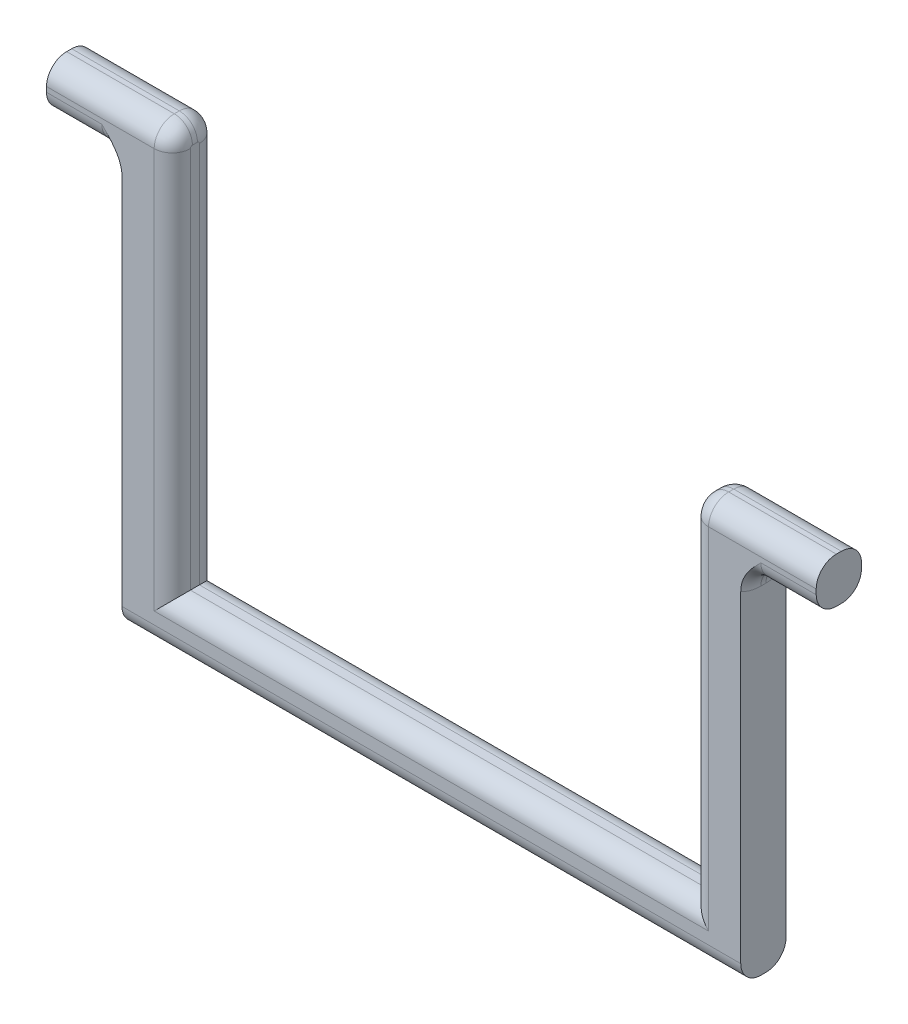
ISO-10303-21;
HEADER;
FILE_DESCRIPTION(('STEP AP214'),'2;1');
FILE_NAME('part.step','',(''),(''),'','','');
FILE_SCHEMA(('AUTOMOTIVE_DESIGN { 1 0 10303 214 1 1 1 1 }'));
ENDSEC;
DATA;
#1=APPLICATION_CONTEXT('core data for automotive mechanical design processes');
#2=APPLICATION_PROTOCOL_DEFINITION('international standard','automotive_design',2000,#1);
#3=PRODUCT_CONTEXT('',#1,'mechanical');
#4=PRODUCT('Part','Part','',(#3));
#5=PRODUCT_RELATED_PRODUCT_CATEGORY('part','',(#4));
#6=PRODUCT_DEFINITION_FORMATION('','',#4);
#7=PRODUCT_DEFINITION_CONTEXT('part definition',#1,'design');
#8=PRODUCT_DEFINITION('design','',#6,#7);
#9=PRODUCT_DEFINITION_SHAPE('','',#8);
#10=(LENGTH_UNIT() NAMED_UNIT(*) SI_UNIT(.MILLI.,.METRE.));
#11=(NAMED_UNIT(*) PLANE_ANGLE_UNIT() SI_UNIT($,.RADIAN.));
#12=(NAMED_UNIT(*) SI_UNIT($,.STERADIAN.) SOLID_ANGLE_UNIT());
#13=UNCERTAINTY_MEASURE_WITH_UNIT(LENGTH_MEASURE(1.E-05),#10,'distance_accuracy_value','');
#14=(GEOMETRIC_REPRESENTATION_CONTEXT(3) GLOBAL_UNCERTAINTY_ASSIGNED_CONTEXT((#13)) GLOBAL_UNIT_ASSIGNED_CONTEXT((#10,
#11,#12)) REPRESENTATION_CONTEXT('',''));
#15=CARTESIAN_POINT('',(0.,0.,0.));
#16=DIRECTION('',(0.,0.,1.));
#17=DIRECTION('',(1.,0.,0.));
#18=AXIS2_PLACEMENT_3D('',#15,#16,#17);
#19=CARTESIAN_POINT('',(19.05,0.,11.43));
#20=DIRECTION('',(0.,1.,0.));
#21=DIRECTION('',(-1.,0.,0.));
#22=AXIS2_PLACEMENT_3D('',#19,#20,#21);
#23=PLANE('',#22);
#24=DIRECTION('',(1.,0.,0.));
#25=VECTOR('',#24,1.);
#26=CARTESIAN_POINT('',(19.05,0.,5.08));
#27=LINE('',#26,#25);
#28=CARTESIAN_POINT('',(0.,0.,5.08));
#29=VERTEX_POINT('',#28);
#30=CARTESIAN_POINT('',(13.97,0.,5.08));
#31=VERTEX_POINT('',#30);
#32=EDGE_CURVE('E351',#29,#31,#27,.T.);
#33=ORIENTED_EDGE('',*,*,#32,.T.);
#34=DIRECTION('',(0.,0.,-1.));
#35=VECTOR('',#34,1.);
#36=CARTESIAN_POINT('',(13.97,0.,6.35));
#37=LINE('',#36,#35);
#38=CARTESIAN_POINT('',(13.97,0.,6.35));
#39=VERTEX_POINT('',#38);
#40=EDGE_CURVE('E587',#31,#39,#37,.F.);
#41=ORIENTED_EDGE('',*,*,#40,.T.);
#42=DIRECTION('',(1.,0.,0.));
#43=VECTOR('',#42,1.);
#44=CARTESIAN_POINT('',(19.05,0.,6.35));
#45=LINE('',#44,#43);
#46=CARTESIAN_POINT('',(0.,0.,6.35));
#47=VERTEX_POINT('',#46);
#48=EDGE_CURVE('E355',#39,#47,#45,.F.);
#49=ORIENTED_EDGE('',*,*,#48,.T.);
#50=DIRECTION('',(0.,0.,-1.));
#51=VECTOR('',#50,1.);
#52=CARTESIAN_POINT('',(0.,0.,11.43));
#53=LINE('',#52,#51);
#54=EDGE_CURVE('E292',#47,#29,#53,.T.);
#55=ORIENTED_EDGE('',*,*,#54,.T.);
#56=EDGE_LOOP('',(#33,#41,#49,#55));
#57=FACE_BOUND('',#56,.T.);
#58=ADVANCED_FACE('F41',(#57),#23,.F.);
#59=CARTESIAN_POINT('',(19.05,-102.87,11.43));
#60=DIRECTION('',(1.,0.,0.));
#61=DIRECTION('',(0.,1.,0.));
#62=AXIS2_PLACEMENT_3D('',#59,#60,#61);
#63=PLANE('',#62);
#64=DIRECTION('',(0.,-1.,0.));
#65=VECTOR('',#64,1.);
#66=CARTESIAN_POINT('',(19.05,-102.87,11.43));
#67=LINE('',#66,#65);
#68=CARTESIAN_POINT('',(19.05,-3.71881810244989,11.43));
#69=VERTEX_POINT('',#68);
#70=CARTESIAN_POINT('',(19.05,-97.79,11.43));
#71=VERTEX_POINT('',#70);
#72=EDGE_CURVE('E294',#69,#71,#67,.T.);
#73=ORIENTED_EDGE('',*,*,#72,.F.);
#74=CARTESIAN_POINT('',(19.05,5.08,6.35));
#75=DIRECTION('',(1.,0.,0.));
#76=DIRECTION('',(0.,1.,0.));
#77=AXIS2_PLACEMENT_3D('',#74,#75,#76);
#78=CIRCLE('',#77,10.16);
#79=CARTESIAN_POINT('',(19.05,-5.08,6.35));
#80=VERTEX_POINT('',#79);
#81=EDGE_CURVE('E562',#69,#80,#78,.T.);
#82=ORIENTED_EDGE('',*,*,#81,.T.);
#83=DIRECTION('',(0.,0.,-1.));
#84=VECTOR('',#83,1.);
#85=CARTESIAN_POINT('',(19.05,-5.08,5.08));
#86=LINE('',#85,#84);
#87=CARTESIAN_POINT('',(19.05,-5.08,5.08));
#88=VERTEX_POINT('',#87);
#89=EDGE_CURVE('E556',#80,#88,#86,.T.);
#90=ORIENTED_EDGE('',*,*,#89,.T.);
#91=CARTESIAN_POINT('',(19.05,5.08,5.08));
#92=DIRECTION('',(1.,0.,0.));
#93=DIRECTION('',(0.,1.,0.));
#94=AXIS2_PLACEMENT_3D('',#91,#92,#93);
#95=CIRCLE('',#94,10.16);
#96=CARTESIAN_POINT('',(19.05,-3.71881810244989,0.));
#97=VERTEX_POINT('',#96);
#98=EDGE_CURVE('E559',#88,#97,#95,.T.);
#99=ORIENTED_EDGE('',*,*,#98,.T.);
#100=DIRECTION('',(0.,-1.,0.));
#101=VECTOR('',#100,1.);
#102=CARTESIAN_POINT('',(19.05,-102.87,0.));
#103=LINE('',#102,#101);
#104=CARTESIAN_POINT('',(19.05,-97.79,0.));
#105=VERTEX_POINT('',#104);
#106=EDGE_CURVE('E298',#97,#105,#103,.T.);
#107=ORIENTED_EDGE('',*,*,#106,.T.);
#108=CARTESIAN_POINT('',(19.05,-97.79,5.08));
#109=DIRECTION('',(1.,0.,0.));
#110=DIRECTION('',(0.,1.,0.));
#111=AXIS2_PLACEMENT_3D('',#108,#109,#110);
#112=CIRCLE('',#111,5.08);
#113=CARTESIAN_POINT('',(19.05,-102.87,5.08));
#114=VERTEX_POINT('',#113);
#115=EDGE_CURVE('E549',#105,#114,#112,.F.);
#116=ORIENTED_EDGE('',*,*,#115,.T.);
#117=DIRECTION('',(0.,0.,-1.));
#118=VECTOR('',#117,1.);
#119=CARTESIAN_POINT('',(19.05,-102.87,11.43));
#120=LINE('',#119,#118);
#121=CARTESIAN_POINT('',(19.05,-102.87,6.35));
#122=VERTEX_POINT('',#121);
#123=EDGE_CURVE('E340',#122,#114,#120,.T.);
#124=ORIENTED_EDGE('',*,*,#123,.F.);
#125=CARTESIAN_POINT('',(19.05,-97.79,6.35));
#126=DIRECTION('',(1.,0.,0.));
#127=DIRECTION('',(0.,1.,0.));
#128=AXIS2_PLACEMENT_3D('',#125,#126,#127);
#129=CIRCLE('',#128,5.08);
#130=EDGE_CURVE('E545',#122,#71,#129,.F.);
#131=ORIENTED_EDGE('',*,*,#130,.T.);
#132=EDGE_LOOP('',(#73,#82,#90,#99,#107,#116,#124,#131));
#133=FACE_BOUND('',#132,.T.);
#134=ADVANCED_FACE('F646',(#133),#63,.F.);
#135=CARTESIAN_POINT('',(175.26,-102.87,11.43));
#136=DIRECTION('',(0.,1.,0.));
#137=DIRECTION('',(0.,0.,1.));
#138=AXIS2_PLACEMENT_3D('',#135,#136,#137);
#139=PLANE('',#138);
#140=ORIENTED_EDGE('',*,*,#123,.T.);
#141=DIRECTION('',(1.,0.,0.));
#142=VECTOR('',#141,1.);
#143=CARTESIAN_POINT('',(175.26,-102.87,5.08));
#144=LINE('',#143,#142);
#145=CARTESIAN_POINT('',(175.26,-102.87,5.08));
#146=VERTEX_POINT('',#145);
#147=EDGE_CURVE('E531',#114,#146,#144,.T.);
#148=ORIENTED_EDGE('',*,*,#147,.T.);
#149=DIRECTION('',(0.,0.,-1.));
#150=VECTOR('',#149,1.);
#151=CARTESIAN_POINT('',(175.26,-102.87,11.43));
#152=LINE('',#151,#150);
#153=CARTESIAN_POINT('',(175.26,-102.87,6.35));
#154=VERTEX_POINT('',#153);
#155=EDGE_CURVE('E336',#154,#146,#152,.T.);
#156=ORIENTED_EDGE('',*,*,#155,.F.);
#157=DIRECTION('',(1.,0.,0.));
#158=VECTOR('',#157,1.);
#159=CARTESIAN_POINT('',(175.26,-102.87,6.35));
#160=LINE('',#159,#158);
#161=EDGE_CURVE('E482',#154,#122,#160,.F.);
#162=ORIENTED_EDGE('',*,*,#161,.T.);
#163=EDGE_LOOP('',(#140,#148,#156,#162));
#164=FACE_BOUND('',#163,.T.);
#165=ADVANCED_FACE('F652',(#164),#139,.F.);
#166=CARTESIAN_POINT('',(175.26,-12.7,11.43));
#167=DIRECTION('',(-1.,0.,0.));
#168=DIRECTION('',(0.,0.,1.));
#169=AXIS2_PLACEMENT_3D('',#166,#167,#168);
#170=PLANE('',#169);
#171=DIRECTION('',(0.,0.,-1.));
#172=VECTOR('',#171,1.);
#173=CARTESIAN_POINT('',(175.26,-17.78,6.35));
#174=LINE('',#173,#172);
#175=CARTESIAN_POINT('',(175.26,-17.78,5.08));
#176=VERTEX_POINT('',#175);
#177=CARTESIAN_POINT('',(175.26,-17.78,6.35));
#178=VERTEX_POINT('',#177);
#179=EDGE_CURVE('E575',#176,#178,#174,.F.);
#180=ORIENTED_EDGE('',*,*,#179,.T.);
#181=CARTESIAN_POINT('',(175.26,-7.61999999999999,6.35));
#182=DIRECTION('',(-1.,0.,0.));
#183=DIRECTION('',(0.,0.,1.));
#184=AXIS2_PLACEMENT_3D('',#181,#182,#183);
#185=CIRCLE('',#184,10.16);
#186=CARTESIAN_POINT('',(175.26,-16.4188181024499,11.43));
#187=VERTEX_POINT('',#186);
#188=EDGE_CURVE('E578',#178,#187,#185,.T.);
#189=ORIENTED_EDGE('',*,*,#188,.T.);
#190=DIRECTION('',(0.,1.,0.));
#191=VECTOR('',#190,1.);
#192=CARTESIAN_POINT('',(175.26,-12.7,11.43));
#193=LINE('',#192,#191);
#194=CARTESIAN_POINT('',(175.26,-97.79,11.43));
#195=VERTEX_POINT('',#194);
#196=EDGE_CURVE('E287',#195,#187,#193,.T.);
#197=ORIENTED_EDGE('',*,*,#196,.F.);
#198=CARTESIAN_POINT('',(175.26,-97.79,6.35));
#199=DIRECTION('',(-1.,0.,0.));
#200=DIRECTION('',(0.,0.,1.));
#201=AXIS2_PLACEMENT_3D('',#198,#199,#200);
#202=CIRCLE('',#201,5.08);
#203=EDGE_CURVE('E535',#195,#154,#202,.F.);
#204=ORIENTED_EDGE('',*,*,#203,.T.);
#205=ORIENTED_EDGE('',*,*,#155,.T.);
#206=CARTESIAN_POINT('',(175.26,-97.79,5.08));
#207=DIRECTION('',(-1.,0.,0.));
#208=DIRECTION('',(0.,0.,1.));
#209=AXIS2_PLACEMENT_3D('',#206,#207,#208);
#210=CIRCLE('',#209,5.08);
#211=CARTESIAN_POINT('',(175.26,-97.79,0.));
#212=VERTEX_POINT('',#211);
#213=EDGE_CURVE('E538',#146,#212,#210,.F.);
#214=ORIENTED_EDGE('',*,*,#213,.T.);
#215=DIRECTION('',(0.,1.,0.));
#216=VECTOR('',#215,1.);
#217=CARTESIAN_POINT('',(175.26,-12.7,0.));
#218=LINE('',#217,#216);
#219=CARTESIAN_POINT('',(175.26,-16.4188181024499,0.));
#220=VERTEX_POINT('',#219);
#221=EDGE_CURVE('E301',#212,#220,#218,.T.);
#222=ORIENTED_EDGE('',*,*,#221,.T.);
#223=CARTESIAN_POINT('',(175.26,-7.61999999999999,5.08));
#224=DIRECTION('',(-1.,0.,0.));
#225=DIRECTION('',(0.,0.,1.));
#226=AXIS2_PLACEMENT_3D('',#223,#224,#225);
#227=CIRCLE('',#226,10.16);
#228=EDGE_CURVE('E572',#220,#176,#227,.T.);
#229=ORIENTED_EDGE('',*,*,#228,.T.);
#230=EDGE_LOOP('',(#180,#189,#197,#204,#205,#214,#222,#229));
#231=FACE_BOUND('',#230,.T.);
#232=ADVANCED_FACE('F758',(#231),#170,.F.);
#233=CARTESIAN_POINT('',(194.31,-12.7,11.43));
#234=DIRECTION('',(0.,1.,0.));
#235=DIRECTION('',(-1.,0.,0.));
#236=AXIS2_PLACEMENT_3D('',#233,#234,#235);
#237=PLANE('',#236);
#238=DIRECTION('',(1.,0.,0.));
#239=VECTOR('',#238,1.);
#240=CARTESIAN_POINT('',(194.31,-12.7,6.35));
#241=LINE('',#240,#239);
#242=CARTESIAN_POINT('',(194.31,-12.7,6.35));
#243=VERTEX_POINT('',#242);
#244=CARTESIAN_POINT('',(180.34,-12.7,6.35));
#245=VERTEX_POINT('',#244);
#246=EDGE_CURVE('E273',#243,#245,#241,.F.);
#247=ORIENTED_EDGE('',*,*,#246,.T.);
#248=DIRECTION('',(0.,0.,-1.));
#249=VECTOR('',#248,1.);
#250=CARTESIAN_POINT('',(180.34,-12.7,5.08));
#251=LINE('',#250,#249);
#252=CARTESIAN_POINT('',(180.34,-12.7,5.08));
#253=VERTEX_POINT('',#252);
#254=EDGE_CURVE('E68',#245,#253,#251,.T.);
#255=ORIENTED_EDGE('',*,*,#254,.T.);
#256=DIRECTION('',(1.,0.,0.));
#257=VECTOR('',#256,1.);
#258=CARTESIAN_POINT('',(194.31,-12.7,5.08));
#259=LINE('',#258,#257);
#260=CARTESIAN_POINT('',(194.31,-12.7,5.08));
#261=VERTEX_POINT('',#260);
#262=EDGE_CURVE('E392',#253,#261,#259,.T.);
#263=ORIENTED_EDGE('',*,*,#262,.T.);
#264=DIRECTION('',(0.,0.,-1.));
#265=VECTOR('',#264,1.);
#266=CARTESIAN_POINT('',(194.31,-12.7,11.43));
#267=LINE('',#266,#265);
#268=EDGE_CURVE('E333',#243,#261,#267,.T.);
#269=ORIENTED_EDGE('',*,*,#268,.F.);
#270=EDGE_LOOP('',(#247,#255,#263,#269));
#271=FACE_BOUND('',#270,.T.);
#272=ADVANCED_FACE('F772',(#271),#237,.F.);
#273=CARTESIAN_POINT('',(194.31,-1.26999999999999,11.43));
#274=DIRECTION('',(-1.,0.,0.));
#275=DIRECTION('',(0.,0.,1.));
#276=AXIS2_PLACEMENT_3D('',#273,#274,#275);
#277=PLANE('',#276);
#278=ORIENTED_EDGE('',*,*,#268,.T.);
#279=CARTESIAN_POINT('',(194.31,-7.61999999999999,5.08));
#280=DIRECTION('',(-1.,0.,0.));
#281=DIRECTION('',(0.,0.,1.));
#282=AXIS2_PLACEMENT_3D('',#279,#280,#281);
#283=CIRCLE('',#282,5.08);
#284=CARTESIAN_POINT('',(194.31,-7.61999999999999,0.));
#285=VERTEX_POINT('',#284);
#286=EDGE_CURVE('E278',#261,#285,#283,.F.);
#287=ORIENTED_EDGE('',*,*,#286,.T.);
#288=DIRECTION('',(0.,1.,0.));
#289=VECTOR('',#288,1.);
#290=CARTESIAN_POINT('',(194.31,-1.26999999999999,0.));
#291=LINE('',#290,#289);
#292=CARTESIAN_POINT('',(194.31,-6.34999999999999,0.));
#293=VERTEX_POINT('',#292);
#294=EDGE_CURVE('E306',#285,#293,#291,.T.);
#295=ORIENTED_EDGE('',*,*,#294,.T.);
#296=CARTESIAN_POINT('',(194.31,-6.34999999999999,5.08));
#297=DIRECTION('',(-1.,0.,0.));
#298=DIRECTION('',(0.,0.,1.));
#299=AXIS2_PLACEMENT_3D('',#296,#297,#298);
#300=CIRCLE('',#299,5.08);
#301=CARTESIAN_POINT('',(194.31,-1.26999999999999,5.08));
#302=VERTEX_POINT('',#301);
#303=EDGE_CURVE('E279',#293,#302,#300,.F.);
#304=ORIENTED_EDGE('',*,*,#303,.T.);
#305=DIRECTION('',(0.,0.,-1.));
#306=VECTOR('',#305,1.);
#307=CARTESIAN_POINT('',(194.31,-1.26999999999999,11.43));
#308=LINE('',#307,#306);
#309=CARTESIAN_POINT('',(194.31,-1.26999999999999,6.35));
#310=VERTEX_POINT('',#309);
#311=EDGE_CURVE('E329',#310,#302,#308,.T.);
#312=ORIENTED_EDGE('',*,*,#311,.F.);
#313=CARTESIAN_POINT('',(194.31,-6.34999999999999,6.35));
#314=DIRECTION('',(-1.,0.,0.));
#315=DIRECTION('',(0.,0.,1.));
#316=AXIS2_PLACEMENT_3D('',#313,#314,#315);
#317=CIRCLE('',#316,5.08);
#318=CARTESIAN_POINT('',(194.31,-6.34999999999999,11.43));
#319=VERTEX_POINT('',#318);
#320=EDGE_CURVE('E284',#310,#319,#317,.F.);
#321=ORIENTED_EDGE('',*,*,#320,.T.);
#322=DIRECTION('',(0.,1.,0.));
#323=VECTOR('',#322,1.);
#324=CARTESIAN_POINT('',(194.31,-1.26999999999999,11.43));
#325=LINE('',#324,#323);
#326=CARTESIAN_POINT('',(194.31,-7.61999999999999,11.43));
#327=VERTEX_POINT('',#326);
#328=EDGE_CURVE('E261',#327,#319,#325,.T.);
#329=ORIENTED_EDGE('',*,*,#328,.F.);
#330=CARTESIAN_POINT('',(194.31,-7.61999999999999,6.35));
#331=DIRECTION('',(-1.,0.,0.));
#332=DIRECTION('',(0.,0.,1.));
#333=AXIS2_PLACEMENT_3D('',#330,#331,#332);
#334=CIRCLE('',#333,5.08);
#335=EDGE_CURVE('E271',#327,#243,#334,.F.);
#336=ORIENTED_EDGE('',*,*,#335,.T.);
#337=EDGE_LOOP('',(#278,#287,#295,#304,#312,#321,#329,#336));
#338=FACE_BOUND('',#337,.T.);
#339=ADVANCED_FACE('F281',(#338),#277,.F.);
#340=CARTESIAN_POINT('',(162.56,-1.26999999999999,11.43));
#341=DIRECTION('',(0.,-1.,0.));
#342=DIRECTION('',(0.,0.,-1.));
#343=AXIS2_PLACEMENT_3D('',#340,#341,#342);
#344=PLANE('',#343);
#345=DIRECTION('',(-1.,0.,0.));
#346=VECTOR('',#345,1.);
#347=CARTESIAN_POINT('',(162.56,-1.26999999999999,5.08));
#348=LINE('',#347,#346);
#349=CARTESIAN_POINT('',(167.132,-1.26999999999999,5.08));
#350=VERTEX_POINT('',#349);
#351=EDGE_CURVE('E404',#302,#350,#348,.T.);
#352=ORIENTED_EDGE('',*,*,#351,.T.);
#353=DIRECTION('',(0.,0.,-1.));
#354=VECTOR('',#353,1.);
#355=CARTESIAN_POINT('',(167.132,-1.26999999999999,11.43));
#356=LINE('',#355,#354);
#357=CARTESIAN_POINT('',(167.132,-1.26999999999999,6.35));
#358=VERTEX_POINT('',#357);
#359=EDGE_CURVE('E461',#350,#358,#356,.F.);
#360=ORIENTED_EDGE('',*,*,#359,.T.);
#361=DIRECTION('',(-1.,0.,0.));
#362=VECTOR('',#361,1.);
#363=CARTESIAN_POINT('',(162.56,-1.26999999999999,6.35));
#364=LINE('',#363,#362);
#365=EDGE_CURVE('E401',#358,#310,#364,.F.);
#366=ORIENTED_EDGE('',*,*,#365,.T.);
#367=ORIENTED_EDGE('',*,*,#311,.T.);
#368=EDGE_LOOP('',(#352,#360,#366,#367));
#369=FACE_BOUND('',#368,.T.);
#370=ADVANCED_FACE('F790',(#369),#344,.F.);
#371=CARTESIAN_POINT('',(162.56,-90.17,11.43));
#372=DIRECTION('',(1.,0.,0.));
#373=DIRECTION('',(0.,0.,-1.));
#374=AXIS2_PLACEMENT_3D('',#371,#372,#373);
#375=PLANE('',#374);
#376=DIRECTION('',(0.,0.,-1.));
#377=VECTOR('',#376,1.);
#378=CARTESIAN_POINT('',(162.56,-90.17,11.43));
#379=LINE('',#378,#377);
#380=CARTESIAN_POINT('',(162.56,-90.17,6.858));
#381=VERTEX_POINT('',#380);
#382=CARTESIAN_POINT('',(162.56,-90.17,4.572));
#383=VERTEX_POINT('',#382);
#384=EDGE_CURVE('E325',#381,#383,#379,.T.);
#385=ORIENTED_EDGE('',*,*,#384,.F.);
#386=DIRECTION('',(0.,-1.,0.));
#387=VECTOR('',#386,1.);
#388=CARTESIAN_POINT('',(162.56,-90.17,6.858));
#389=LINE('',#388,#387);
#390=CARTESIAN_POINT('',(162.56,-6.34999999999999,6.858));
#391=VERTEX_POINT('',#390);
#392=EDGE_CURVE('E455',#381,#391,#389,.F.);
#393=ORIENTED_EDGE('',*,*,#392,.T.);
#394=CARTESIAN_POINT('',(162.56,-6.34999999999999,6.35));
#395=DIRECTION('',(1.,0.,0.));
#396=DIRECTION('',(0.,0.,-1.));
#397=AXIS2_PLACEMENT_3D('',#394,#395,#396);
#398=CIRCLE('',#397,0.508000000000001);
#399=CARTESIAN_POINT('',(162.56,-5.842,6.35));
#400=VERTEX_POINT('',#399);
#401=EDGE_CURVE('E452',#391,#400,#398,.F.);
#402=ORIENTED_EDGE('',*,*,#401,.T.);
#403=DIRECTION('',(0.,0.,-1.));
#404=VECTOR('',#403,1.);
#405=CARTESIAN_POINT('',(162.56,-5.842,11.43));
#406=LINE('',#405,#404);
#407=CARTESIAN_POINT('',(162.56,-5.84199999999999,5.08));
#408=VERTEX_POINT('',#407);
#409=EDGE_CURVE('E449',#400,#408,#406,.T.);
#410=ORIENTED_EDGE('',*,*,#409,.T.);
#411=CARTESIAN_POINT('',(162.56,-6.34999999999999,5.08));
#412=DIRECTION('',(1.,0.,0.));
#413=DIRECTION('',(0.,0.,-1.));
#414=AXIS2_PLACEMENT_3D('',#411,#412,#413);
#415=CIRCLE('',#414,0.508000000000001);
#416=CARTESIAN_POINT('',(162.56,-6.34999999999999,4.572));
#417=VERTEX_POINT('',#416);
#418=EDGE_CURVE('E446',#408,#417,#415,.F.);
#419=ORIENTED_EDGE('',*,*,#418,.T.);
#420=DIRECTION('',(0.,-1.,0.));
#421=VECTOR('',#420,1.);
#422=CARTESIAN_POINT('',(162.56,-90.17,4.572));
#423=LINE('',#422,#421);
#424=EDGE_CURVE('E443',#417,#383,#423,.T.);
#425=ORIENTED_EDGE('',*,*,#424,.T.);
#426=EDGE_LOOP('',(#385,#393,#402,#410,#419,#425));
#427=FACE_BOUND('',#426,.T.);
#428=ADVANCED_FACE('F857',(#427),#375,.F.);
#429=CARTESIAN_POINT('',(162.56,-90.17,11.43));
#430=DIRECTION('',(0.,-1.,0.));
#431=DIRECTION('',(1.,0.,0.));
#432=AXIS2_PLACEMENT_3D('',#429,#430,#431);
#433=PLANE('',#432);
#434=DIRECTION('',(0.,0.,-1.));
#435=VECTOR('',#434,1.);
#436=CARTESIAN_POINT('',(31.75,-90.17,11.43));
#437=LINE('',#436,#435);
#438=CARTESIAN_POINT('',(31.75,-90.17,6.858));
#439=VERTEX_POINT('',#438);
#440=CARTESIAN_POINT('',(31.75,-90.17,4.572));
#441=VERTEX_POINT('',#440);
#442=EDGE_CURVE('E321',#439,#441,#437,.T.);
#443=ORIENTED_EDGE('',*,*,#442,.F.);
#444=DIRECTION('',(-1.,0.,0.));
#445=VECTOR('',#444,1.);
#446=CARTESIAN_POINT('',(162.56,-90.17,6.858));
#447=LINE('',#446,#445);
#448=EDGE_CURVE('E479',#439,#381,#447,.F.);
#449=ORIENTED_EDGE('',*,*,#448,.T.);
#450=ORIENTED_EDGE('',*,*,#384,.T.);
#451=DIRECTION('',(-1.,0.,0.));
#452=VECTOR('',#451,1.);
#453=CARTESIAN_POINT('',(31.75,-90.17,4.572));
#454=LINE('',#453,#452);
#455=EDGE_CURVE('E476',#383,#441,#454,.T.);
#456=ORIENTED_EDGE('',*,*,#455,.T.);
#457=EDGE_LOOP('',(#443,#449,#450,#456));
#458=FACE_BOUND('',#457,.T.);
#459=ADVANCED_FACE('F854',(#458),#433,.F.);
#460=CARTESIAN_POINT('',(31.75,11.43,11.43));
#461=DIRECTION('',(-1.,0.,0.));
#462=DIRECTION('',(0.,-1.,0.));
#463=AXIS2_PLACEMENT_3D('',#460,#461,#462);
#464=PLANE('',#463);
#465=CARTESIAN_POINT('',(31.75,6.35,6.35));
#466=DIRECTION('',(-1.,0.,0.));
#467=DIRECTION('',(0.,-1.,0.));
#468=AXIS2_PLACEMENT_3D('',#465,#466,#467);
#469=CIRCLE('',#468,0.508000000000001);
#470=CARTESIAN_POINT('',(31.75,6.858,6.35));
#471=VERTEX_POINT('',#470);
#472=CARTESIAN_POINT('',(31.75,6.35,6.858));
#473=VERTEX_POINT('',#472);
#474=EDGE_CURVE('E427',#471,#473,#469,.F.);
#475=ORIENTED_EDGE('',*,*,#474,.T.);
#476=DIRECTION('',(0.,1.,0.));
#477=VECTOR('',#476,1.);
#478=CARTESIAN_POINT('',(31.75,11.43,6.858));
#479=LINE('',#478,#477);
#480=EDGE_CURVE('E430',#473,#439,#479,.F.);
#481=ORIENTED_EDGE('',*,*,#480,.T.);
#482=ORIENTED_EDGE('',*,*,#442,.T.);
#483=DIRECTION('',(0.,1.,0.));
#484=VECTOR('',#483,1.);
#485=CARTESIAN_POINT('',(31.75,6.35,4.572));
#486=LINE('',#485,#484);
#487=CARTESIAN_POINT('',(31.75,6.35,4.572));
#488=VERTEX_POINT('',#487);
#489=EDGE_CURVE('E418',#441,#488,#486,.T.);
#490=ORIENTED_EDGE('',*,*,#489,.T.);
#491=CARTESIAN_POINT('',(31.75,6.35,5.08));
#492=DIRECTION('',(-1.,0.,0.));
#493=DIRECTION('',(0.,-1.,0.));
#494=AXIS2_PLACEMENT_3D('',#491,#492,#493);
#495=CIRCLE('',#494,0.508000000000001);
#496=CARTESIAN_POINT('',(31.75,6.858,5.08));
#497=VERTEX_POINT('',#496);
#498=EDGE_CURVE('E421',#488,#497,#495,.F.);
#499=ORIENTED_EDGE('',*,*,#498,.T.);
#500=DIRECTION('',(0.,0.,-1.));
#501=VECTOR('',#500,1.);
#502=CARTESIAN_POINT('',(31.75,6.858,11.43));
#503=LINE('',#502,#501);
#504=EDGE_CURVE('E424',#497,#471,#503,.F.);
#505=ORIENTED_EDGE('',*,*,#504,.T.);
#506=EDGE_LOOP('',(#475,#481,#482,#490,#499,#505));
#507=FACE_BOUND('',#506,.T.);
#508=ADVANCED_FACE('F846',(#507),#464,.F.);
#509=CARTESIAN_POINT('',(0.,11.43,11.43));
#510=DIRECTION('',(0.,-1.,0.));
#511=DIRECTION('',(1.,0.,0.));
#512=AXIS2_PLACEMENT_3D('',#509,#510,#511);
#513=PLANE('',#512);
#514=DIRECTION('',(-1.,0.,0.));
#515=VECTOR('',#514,1.);
#516=CARTESIAN_POINT('',(0.,11.43,6.35));
#517=LINE('',#516,#515);
#518=CARTESIAN_POINT('',(0.,11.43,6.35));
#519=VERTEX_POINT('',#518);
#520=CARTESIAN_POINT('',(27.178,11.43,6.35));
#521=VERTEX_POINT('',#520);
#522=EDGE_CURVE('E373',#519,#521,#517,.F.);
#523=ORIENTED_EDGE('',*,*,#522,.T.);
#524=DIRECTION('',(0.,0.,-1.));
#525=VECTOR('',#524,1.);
#526=CARTESIAN_POINT('',(27.178,11.43,11.43));
#527=LINE('',#526,#525);
#528=CARTESIAN_POINT('',(27.178,11.43,5.08));
#529=VERTEX_POINT('',#528);
#530=EDGE_CURVE('E437',#521,#529,#527,.T.);
#531=ORIENTED_EDGE('',*,*,#530,.T.);
#532=DIRECTION('',(-1.,0.,0.));
#533=VECTOR('',#532,1.);
#534=CARTESIAN_POINT('',(0.,11.43,5.08));
#535=LINE('',#534,#533);
#536=CARTESIAN_POINT('',(0.,11.43,5.08));
#537=VERTEX_POINT('',#536);
#538=EDGE_CURVE('E370',#529,#537,#535,.T.);
#539=ORIENTED_EDGE('',*,*,#538,.T.);
#540=DIRECTION('',(0.,0.,-1.));
#541=VECTOR('',#540,1.);
#542=CARTESIAN_POINT('',(0.,11.43,11.43));
#543=LINE('',#542,#541);
#544=EDGE_CURVE('E317',#519,#537,#543,.T.);
#545=ORIENTED_EDGE('',*,*,#544,.F.);
#546=EDGE_LOOP('',(#523,#531,#539,#545));
#547=FACE_BOUND('',#546,.T.);
#548=ADVANCED_FACE('F920',(#547),#513,.F.);
#549=CARTESIAN_POINT('',(0.,0.,11.43));
#550=DIRECTION('',(1.,0.,0.));
#551=DIRECTION('',(0.,0.,-1.));
#552=AXIS2_PLACEMENT_3D('',#549,#550,#551);
#553=PLANE('',#552);
#554=ORIENTED_EDGE('',*,*,#54,.F.);
#555=CARTESIAN_POINT('',(0.,5.08,6.35));
#556=DIRECTION('',(1.,0.,0.));
#557=DIRECTION('',(0.,0.,-1.));
#558=AXIS2_PLACEMENT_3D('',#555,#556,#557);
#559=CIRCLE('',#558,5.08);
#560=CARTESIAN_POINT('',(0.,5.08,11.43));
#561=VERTEX_POINT('',#560);
#562=EDGE_CURVE('E367',#47,#561,#559,.F.);
#563=ORIENTED_EDGE('',*,*,#562,.T.);
#564=DIRECTION('',(0.,-1.,0.));
#565=VECTOR('',#564,1.);
#566=CARTESIAN_POINT('',(0.,0.,11.43));
#567=LINE('',#566,#565);
#568=CARTESIAN_POINT('',(0.,6.34999999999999,11.43));
#569=VERTEX_POINT('',#568);
#570=EDGE_CURVE('E286',#569,#561,#567,.T.);
#571=ORIENTED_EDGE('',*,*,#570,.F.);
#572=CARTESIAN_POINT('',(0.,6.34999999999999,6.35));
#573=DIRECTION('',(1.,0.,0.));
#574=DIRECTION('',(0.,0.,-1.));
#575=AXIS2_PLACEMENT_3D('',#572,#573,#574);
#576=CIRCLE('',#575,5.08);
#577=EDGE_CURVE('E364',#569,#519,#576,.F.);
#578=ORIENTED_EDGE('',*,*,#577,.T.);
#579=ORIENTED_EDGE('',*,*,#544,.T.);
#580=CARTESIAN_POINT('',(0.,6.34999999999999,5.08));
#581=DIRECTION('',(1.,0.,0.));
#582=DIRECTION('',(0.,0.,-1.));
#583=AXIS2_PLACEMENT_3D('',#580,#581,#582);
#584=CIRCLE('',#583,5.08);
#585=CARTESIAN_POINT('',(0.,6.34999999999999,0.));
#586=VERTEX_POINT('',#585);
#587=EDGE_CURVE('E358',#537,#586,#584,.F.);
#588=ORIENTED_EDGE('',*,*,#587,.T.);
#589=DIRECTION('',(0.,-1.,0.));
#590=VECTOR('',#589,1.);
#591=CARTESIAN_POINT('',(0.,0.,0.));
#592=LINE('',#591,#590);
#593=CARTESIAN_POINT('',(0.,5.08,0.));
#594=VERTEX_POINT('',#593);
#595=EDGE_CURVE('E310',#586,#594,#592,.T.);
#596=ORIENTED_EDGE('',*,*,#595,.T.);
#597=CARTESIAN_POINT('',(0.,5.08,5.08));
#598=DIRECTION('',(1.,0.,0.));
#599=DIRECTION('',(0.,0.,-1.));
#600=AXIS2_PLACEMENT_3D('',#597,#598,#599);
#601=CIRCLE('',#600,5.08);
#602=EDGE_CURVE('E361',#594,#29,#601,.F.);
#603=ORIENTED_EDGE('',*,*,#602,.T.);
#604=EDGE_LOOP('',(#554,#563,#571,#578,#579,#588,#596,#603));
#605=FACE_BOUND('',#604,.T.);
#606=ADVANCED_FACE('F616',(#605),#553,.F.);
#607=CARTESIAN_POINT('',(0.,0.,11.43));
#608=DIRECTION('',(0.,0.,-1.));
#609=DIRECTION('',(-1.,0.,0.));
#610=AXIS2_PLACEMENT_3D('',#607,#608,#609);
#611=PLANE('',#610);
#612=DIRECTION('',(1.,0.,0.));
#613=VECTOR('',#612,1.);
#614=CARTESIAN_POINT('',(0.,5.08,11.43));
#615=LINE('',#614,#613);
#616=CARTESIAN_POINT('',(13.97,5.08,11.43));
#617=VERTEX_POINT('',#616);
#618=EDGE_CURVE('E348',#561,#617,#615,.T.);
#619=ORIENTED_EDGE('',*,*,#618,.T.);
#620=CARTESIAN_POINT('',(19.05,-3.7188181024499,11.43));
#621=CARTESIAN_POINT('',(19.0500301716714,-3.50115198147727,11.43));
#622=CARTESIAN_POINT('',(19.039512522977,-3.28361297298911,11.43));
#623=CARTESIAN_POINT('',(18.9988263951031,-2.85069507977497,11.43));
#624=CARTESIAN_POINT('',(18.968687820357,-2.63531341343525,11.43));
#625=CARTESIAN_POINT('',(18.890668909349,-2.21051887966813,11.43));
#626=CARTESIAN_POINT('',(18.8430066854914,-2.00106536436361,11.43));
#627=CARTESIAN_POINT('',(18.7313850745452,-1.586480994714,11.43));
#628=CARTESIAN_POINT('',(18.6674179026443,-1.38135225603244,11.43));
#629=CARTESIAN_POINT('',(18.4981693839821,-0.90095230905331,11.43));
#630=CARTESIAN_POINT('',(18.3863708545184,-0.627970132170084,11.43));
#631=CARTESIAN_POINT('',(18.1389666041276,-0.0930646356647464,11.43));
#632=CARTESIAN_POINT('',(18.0033536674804,0.168855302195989,11.43));
#633=CARTESIAN_POINT('',(17.7114972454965,0.682503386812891,11.43));
#634=CARTESIAN_POINT('',(17.5551583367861,0.934176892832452,11.43));
#635=CARTESIAN_POINT('',(17.225962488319,1.42655361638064,11.43));
#636=CARTESIAN_POINT('',(17.0530979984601,1.66725174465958,11.43));
#637=CARTESIAN_POINT('',(16.4401814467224,2.47244782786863,11.43));
#638=CARTESIAN_POINT('',(15.9685073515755,3.01265193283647,11.43));
#639=CARTESIAN_POINT('',(14.9912707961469,4.05854684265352,11.43));
#640=CARTESIAN_POINT('',(14.4857348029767,4.56426399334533,11.43));
#641=CARTESIAN_POINT('',(13.9767197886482,5.07328020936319,11.43));
#642=CARTESIAN_POINT('',(13.9733598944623,5.07664010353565,11.43));
#643=CARTESIAN_POINT('',(13.97,5.08,11.43));
#644=B_SPLINE_CURVE_WITH_KNOTS('',3,(#620,#621,#622,#623,#624,#625,#626,#627,#628,#629,#630,
#631,#632,#633,#634,#635,#636,#637,#638,#639,#640,#641,#642,#643),.UNSPECIFIED.,.F.,.F.,(4,2,2,
2,2,2,2,2,2,2,2,4),(0.,0.652558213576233,1.30412417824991,1.94784060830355,2.59186495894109,
3.4754311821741,4.35926558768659,5.24732051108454,6.13578312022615,8.28275844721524,
10.4280748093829,10.4423296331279),.UNSPECIFIED.);
#645=EDGE_CURVE('E592',#617,#69,#644,.F.);
#646=ORIENTED_EDGE('',*,*,#645,.T.);
#647=ORIENTED_EDGE('',*,*,#72,.T.);
#648=DIRECTION('',(1.,0.,0.));
#649=VECTOR('',#648,1.);
#650=CARTESIAN_POINT('',(0.,-97.79,11.43));
#651=LINE('',#650,#649);
#652=EDGE_CURVE('E552',#71,#195,#651,.T.);
#653=ORIENTED_EDGE('',*,*,#652,.T.);
#654=ORIENTED_EDGE('',*,*,#196,.T.);
#655=CARTESIAN_POINT('',(175.26,-16.4188181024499,11.43));
#656=CARTESIAN_POINT('',(175.259969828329,-16.2011519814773,11.43));
#657=CARTESIAN_POINT('',(175.270487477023,-15.9836129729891,11.43));
#658=CARTESIAN_POINT('',(175.311173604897,-15.5506950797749,11.43));
#659=CARTESIAN_POINT('',(175.341312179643,-15.3353134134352,11.43));
#660=CARTESIAN_POINT('',(175.419331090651,-14.9105188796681,11.43));
#661=CARTESIAN_POINT('',(175.466993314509,-14.7010653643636,11.43));
#662=CARTESIAN_POINT('',(175.578614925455,-14.286480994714,11.43));
#663=CARTESIAN_POINT('',(175.642582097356,-14.0813522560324,11.43));
#664=CARTESIAN_POINT('',(175.811830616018,-13.6009523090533,11.43));
#665=CARTESIAN_POINT('',(175.923629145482,-13.3279701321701,11.43));
#666=CARTESIAN_POINT('',(176.171033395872,-12.7930646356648,11.43));
#667=CARTESIAN_POINT('',(176.30664633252,-12.531144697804,11.43));
#668=CARTESIAN_POINT('',(176.598502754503,-12.0174966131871,11.43));
#669=CARTESIAN_POINT('',(176.754841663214,-11.7658231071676,11.43));
#670=CARTESIAN_POINT('',(177.084037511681,-11.2734463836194,11.43));
#671=CARTESIAN_POINT('',(177.25690200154,-11.0327482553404,11.43));
#672=CARTESIAN_POINT('',(177.869818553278,-10.2275521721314,11.43));
#673=CARTESIAN_POINT('',(178.341492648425,-9.68734806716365,11.43));
#674=CARTESIAN_POINT('',(179.318729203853,-8.64145315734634,11.43));
#675=CARTESIAN_POINT('',(179.824265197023,-8.13573600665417,11.43));
#676=CARTESIAN_POINT('',(180.333280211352,-7.62671979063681,11.43));
#677=CARTESIAN_POINT('',(180.336640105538,-7.62335989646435,11.43));
#678=CARTESIAN_POINT('',(180.34,-7.61999999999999,11.43));
#679=B_SPLINE_CURVE_WITH_KNOTS('',3,(#655,#656,#657,#658,#659,#660,#661,#662,#663,#664,#665,
#666,#667,#668,#669,#670,#671,#672,#673,#674,#675,#676,#677,#678),.UNSPECIFIED.,.F.,.F.,(4,2,2,
2,2,2,2,2,2,2,2,4),(0.,0.652558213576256,1.30412417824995,1.94784060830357,2.59186495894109,
3.47543118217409,4.35926558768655,5.24732051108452,6.13578312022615,8.28275844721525,
10.4280748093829,10.4423296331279),.UNSPECIFIED.);
#680=CARTESIAN_POINT('',(180.34,-7.61999999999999,11.43));
#681=VERTEX_POINT('',#680);
#682=EDGE_CURVE('E52',#187,#681,#679,.T.);
#683=ORIENTED_EDGE('',*,*,#682,.T.);
#684=DIRECTION('',(1.,0.,0.));
#685=VECTOR('',#684,1.);
#686=CARTESIAN_POINT('',(0.,-7.62000000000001,11.43));
#687=LINE('',#686,#685);
#688=EDGE_CURVE('E255',#681,#327,#687,.T.);
#689=ORIENTED_EDGE('',*,*,#688,.T.);
#690=ORIENTED_EDGE('',*,*,#328,.T.);
#691=DIRECTION('',(-1.,0.,0.));
#692=VECTOR('',#691,1.);
#693=CARTESIAN_POINT('',(0.,-6.34999999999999,11.43));
#694=LINE('',#693,#692);
#695=CARTESIAN_POINT('',(167.132,-6.34999999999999,11.43));
#696=VERTEX_POINT('',#695);
#697=EDGE_CURVE('E268',#319,#696,#694,.T.);
#698=ORIENTED_EDGE('',*,*,#697,.T.);
#699=DIRECTION('',(0.,-1.,0.));
#700=VECTOR('',#699,1.);
#701=CARTESIAN_POINT('',(167.132,0.,11.43));
#702=LINE('',#701,#700);
#703=CARTESIAN_POINT('',(167.132,-94.742,11.43));
#704=VERTEX_POINT('',#703);
#705=EDGE_CURVE('E411',#696,#704,#702,.T.);
#706=ORIENTED_EDGE('',*,*,#705,.T.);
#707=DIRECTION('',(-1.,0.,0.));
#708=VECTOR('',#707,1.);
#709=CARTESIAN_POINT('',(0.,-94.742,11.43));
#710=LINE('',#709,#708);
#711=CARTESIAN_POINT('',(27.178,-94.742,11.43));
#712=VERTEX_POINT('',#711);
#713=EDGE_CURVE('E408',#704,#712,#710,.T.);
#714=ORIENTED_EDGE('',*,*,#713,.T.);
#715=DIRECTION('',(0.,1.,0.));
#716=VECTOR('',#715,1.);
#717=CARTESIAN_POINT('',(27.178,0.,11.43));
#718=LINE('',#717,#716);
#719=CARTESIAN_POINT('',(27.178,6.34999999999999,11.43));
#720=VERTEX_POINT('',#719);
#721=EDGE_CURVE('E414',#712,#720,#718,.T.);
#722=ORIENTED_EDGE('',*,*,#721,.T.);
#723=DIRECTION('',(-1.,0.,0.));
#724=VECTOR('',#723,1.);
#725=CARTESIAN_POINT('',(0.,6.34999999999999,11.43));
#726=LINE('',#725,#724);
#727=EDGE_CURVE('E267',#720,#569,#726,.T.);
#728=ORIENTED_EDGE('',*,*,#727,.T.);
#729=ORIENTED_EDGE('',*,*,#570,.T.);
#730=EDGE_LOOP('',(#619,#646,#647,#653,#654,#683,#689,#690,#698,#706,#714,#722,#728,#729));
#731=FACE_BOUND('',#730,.T.);
#732=ADVANCED_FACE('F258',(#731),#611,.F.);
#733=CARTESIAN_POINT('',(0.,0.,0.));
#734=DIRECTION('',(0.,0.,-1.));
#735=DIRECTION('',(-1.,0.,0.));
#736=AXIS2_PLACEMENT_3D('',#733,#734,#735);
#737=PLANE('',#736);
#738=ORIENTED_EDGE('',*,*,#221,.F.);
#739=DIRECTION('',(1.,0.,0.));
#740=VECTOR('',#739,1.);
#741=CARTESIAN_POINT('',(19.05,-97.79,0.));
#742=LINE('',#741,#740);
#743=EDGE_CURVE('E541',#212,#105,#742,.F.);
#744=ORIENTED_EDGE('',*,*,#743,.T.);
#745=ORIENTED_EDGE('',*,*,#106,.F.);
#746=CARTESIAN_POINT('',(19.05,-3.7188181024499,0.));
#747=CARTESIAN_POINT('',(19.0500301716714,-3.50115198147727,0.));
#748=CARTESIAN_POINT('',(19.039512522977,-3.28361297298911,0.));
#749=CARTESIAN_POINT('',(18.9988263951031,-2.85069507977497,0.));
#750=CARTESIAN_POINT('',(18.968687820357,-2.63531341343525,0.));
#751=CARTESIAN_POINT('',(18.890668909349,-2.21051887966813,0.));
#752=CARTESIAN_POINT('',(18.8430066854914,-2.00106536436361,0.));
#753=CARTESIAN_POINT('',(18.7313850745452,-1.586480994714,0.));
#754=CARTESIAN_POINT('',(18.6674179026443,-1.38135225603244,0.));
#755=CARTESIAN_POINT('',(18.4981693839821,-0.90095230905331,0.));
#756=CARTESIAN_POINT('',(18.3863708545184,-0.627970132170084,0.));
#757=CARTESIAN_POINT('',(18.1389666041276,-0.0930646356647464,0.));
#758=CARTESIAN_POINT('',(18.0033536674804,0.168855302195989,0.));
#759=CARTESIAN_POINT('',(17.7114972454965,0.682503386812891,0.));
#760=CARTESIAN_POINT('',(17.5551583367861,0.934176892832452,0.));
#761=CARTESIAN_POINT('',(17.225962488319,1.42655361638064,0.));
#762=CARTESIAN_POINT('',(17.0530979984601,1.66725174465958,0.));
#763=CARTESIAN_POINT('',(16.4401814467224,2.47244782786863,0.));
#764=CARTESIAN_POINT('',(15.9685073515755,3.01265193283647,0.));
#765=CARTESIAN_POINT('',(14.9912707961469,4.05854684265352,0.));
#766=CARTESIAN_POINT('',(14.4857348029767,4.56426399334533,0.));
#767=CARTESIAN_POINT('',(13.9767197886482,5.07328020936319,0.));
#768=CARTESIAN_POINT('',(13.9733598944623,5.07664010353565,0.));
#769=CARTESIAN_POINT('',(13.97,5.08,0.));
#770=B_SPLINE_CURVE_WITH_KNOTS('',3,(#746,#747,#748,#749,#750,#751,#752,#753,#754,#755,#756,
#757,#758,#759,#760,#761,#762,#763,#764,#765,#766,#767,#768,#769),.UNSPECIFIED.,.F.,.F.,(4,2,2,
2,2,2,2,2,2,2,2,4),(0.,0.652558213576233,1.30412417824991,1.94784060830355,2.59186495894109,
3.4754311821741,4.35926558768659,5.24732051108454,6.13578312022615,8.28275844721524,
10.4280748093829,10.4423296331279),.UNSPECIFIED.);
#771=CARTESIAN_POINT('',(13.97,5.08,0.));
#772=VERTEX_POINT('',#771);
#773=EDGE_CURVE('E601',#97,#772,#770,.T.);
#774=ORIENTED_EDGE('',*,*,#773,.T.);
#775=DIRECTION('',(1.,0.,0.));
#776=VECTOR('',#775,1.);
#777=CARTESIAN_POINT('',(0.,5.08,0.));
#778=LINE('',#777,#776);
#779=EDGE_CURVE('E387',#772,#594,#778,.F.);
#780=ORIENTED_EDGE('',*,*,#779,.T.);
#781=ORIENTED_EDGE('',*,*,#595,.F.);
#782=DIRECTION('',(-1.,0.,0.));
#783=VECTOR('',#782,1.);
#784=CARTESIAN_POINT('',(31.75,6.35,0.));
#785=LINE('',#784,#783);
#786=CARTESIAN_POINT('',(27.178,6.34999999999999,0.));
#787=VERTEX_POINT('',#786);
#788=EDGE_CURVE('E383',#586,#787,#785,.F.);
#789=ORIENTED_EDGE('',*,*,#788,.T.);
#790=DIRECTION('',(0.,1.,0.));
#791=VECTOR('',#790,1.);
#792=CARTESIAN_POINT('',(27.178,-90.17,0.));
#793=LINE('',#792,#791);
#794=CARTESIAN_POINT('',(27.178,-94.742,0.));
#795=VERTEX_POINT('',#794);
#796=EDGE_CURVE('E473',#787,#795,#793,.F.);
#797=ORIENTED_EDGE('',*,*,#796,.T.);
#798=DIRECTION('',(-1.,0.,0.));
#799=VECTOR('',#798,1.);
#800=CARTESIAN_POINT('',(162.56,-94.742,0.));
#801=LINE('',#800,#799);
#802=CARTESIAN_POINT('',(167.132,-94.742,0.));
#803=VERTEX_POINT('',#802);
#804=EDGE_CURVE('E467',#795,#803,#801,.F.);
#805=ORIENTED_EDGE('',*,*,#804,.T.);
#806=DIRECTION('',(0.,-1.,0.));
#807=VECTOR('',#806,1.);
#808=CARTESIAN_POINT('',(167.132,-6.34999999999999,0.));
#809=LINE('',#808,#807);
#810=CARTESIAN_POINT('',(167.132,-6.34999999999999,0.));
#811=VERTEX_POINT('',#810);
#812=EDGE_CURVE('E470',#803,#811,#809,.F.);
#813=ORIENTED_EDGE('',*,*,#812,.T.);
#814=DIRECTION('',(-1.,0.,0.));
#815=VECTOR('',#814,1.);
#816=CARTESIAN_POINT('',(194.31,-6.34999999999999,0.));
#817=LINE('',#816,#815);
#818=EDGE_CURVE('E377',#811,#293,#817,.F.);
#819=ORIENTED_EDGE('',*,*,#818,.T.);
#820=ORIENTED_EDGE('',*,*,#294,.F.);
#821=DIRECTION('',(1.,0.,0.));
#822=VECTOR('',#821,1.);
#823=CARTESIAN_POINT('',(175.26,-7.61999999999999,0.));
#824=LINE('',#823,#822);
#825=CARTESIAN_POINT('',(180.34,-7.61999999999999,0.));
#826=VERTEX_POINT('',#825);
#827=EDGE_CURVE('E380',#285,#826,#824,.F.);
#828=ORIENTED_EDGE('',*,*,#827,.T.);
#829=CARTESIAN_POINT('',(175.26,-16.4188181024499,0.));
#830=CARTESIAN_POINT('',(175.259969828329,-16.2011519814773,0.));
#831=CARTESIAN_POINT('',(175.270487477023,-15.9836129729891,0.));
#832=CARTESIAN_POINT('',(175.311173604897,-15.5506950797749,0.));
#833=CARTESIAN_POINT('',(175.341312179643,-15.3353134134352,0.));
#834=CARTESIAN_POINT('',(175.419331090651,-14.9105188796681,0.));
#835=CARTESIAN_POINT('',(175.466993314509,-14.7010653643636,0.));
#836=CARTESIAN_POINT('',(175.578614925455,-14.286480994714,0.));
#837=CARTESIAN_POINT('',(175.642582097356,-14.0813522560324,0.));
#838=CARTESIAN_POINT('',(175.811830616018,-13.6009523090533,0.));
#839=CARTESIAN_POINT('',(175.923629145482,-13.3279701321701,0.));
#840=CARTESIAN_POINT('',(176.171033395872,-12.7930646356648,0.));
#841=CARTESIAN_POINT('',(176.30664633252,-12.531144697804,0.));
#842=CARTESIAN_POINT('',(176.598502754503,-12.0174966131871,0.));
#843=CARTESIAN_POINT('',(176.754841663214,-11.7658231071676,0.));
#844=CARTESIAN_POINT('',(177.084037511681,-11.2734463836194,0.));
#845=CARTESIAN_POINT('',(177.25690200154,-11.0327482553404,0.));
#846=CARTESIAN_POINT('',(177.869818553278,-10.2275521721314,0.));
#847=CARTESIAN_POINT('',(178.341492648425,-9.68734806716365,0.));
#848=CARTESIAN_POINT('',(179.318729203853,-8.64145315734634,0.));
#849=CARTESIAN_POINT('',(179.824265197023,-8.13573600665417,0.));
#850=CARTESIAN_POINT('',(180.333280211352,-7.62671979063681,0.));
#851=CARTESIAN_POINT('',(180.336640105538,-7.62335989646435,0.));
#852=CARTESIAN_POINT('',(180.34,-7.61999999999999,0.));
#853=B_SPLINE_CURVE_WITH_KNOTS('',3,(#829,#830,#831,#832,#833,#834,#835,#836,#837,#838,#839,
#840,#841,#842,#843,#844,#845,#846,#847,#848,#849,#850,#851,#852),.UNSPECIFIED.,.F.,.F.,(4,2,2,
2,2,2,2,2,2,2,2,4),(0.,0.652558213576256,1.30412417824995,1.94784060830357,2.59186495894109,
3.47543118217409,4.35926558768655,5.24732051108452,6.13578312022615,8.28275844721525,
10.4280748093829,10.4423296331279),.UNSPECIFIED.);
#854=EDGE_CURVE('E11',#826,#220,#853,.F.);
#855=ORIENTED_EDGE('',*,*,#854,.T.);
#856=EDGE_LOOP('',(#738,#744,#745,#774,#780,#781,#789,#797,#805,#813,#819,#820,#828,#855));
#857=FACE_BOUND('',#856,.T.);
#858=ADVANCED_FACE('F615',(#857),#737,.T.);
#859=CARTESIAN_POINT('',(0.,5.08,6.35));
#860=DIRECTION('',(1.,0.,0.));
#861=DIRECTION('',(0.,1.,0.));
#862=AXIS2_PLACEMENT_3D('',#859,#860,#861);
#863=CYLINDRICAL_SURFACE('',#862,5.08);
#864=ORIENTED_EDGE('',*,*,#48,.F.);
#865=CARTESIAN_POINT('',(13.97,5.08,6.35));
#866=DIRECTION('',(1.,0.,0.));
#867=DIRECTION('',(0.,1.,0.));
#868=AXIS2_PLACEMENT_3D('',#865,#866,#867);
#869=CIRCLE('',#868,5.08);
#870=EDGE_CURVE('E566',#39,#617,#869,.F.);
#871=ORIENTED_EDGE('',*,*,#870,.T.);
#872=ORIENTED_EDGE('',*,*,#618,.F.);
#873=ORIENTED_EDGE('',*,*,#562,.F.);
#874=EDGE_LOOP('',(#864,#871,#872,#873));
#875=FACE_BOUND('',#874,.T.);
#876=ADVANCED_FACE('F657',(#875),#863,.T.);
#877=CARTESIAN_POINT('',(0.,6.34999999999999,6.35));
#878=DIRECTION('',(-1.,0.,0.));
#879=DIRECTION('',(0.,-1.,0.));
#880=AXIS2_PLACEMENT_3D('',#877,#878,#879);
#881=CYLINDRICAL_SURFACE('',#880,5.08);
#882=ORIENTED_EDGE('',*,*,#727,.F.);
#883=CARTESIAN_POINT('',(27.178,6.34999999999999,6.35));
#884=DIRECTION('',(-1.,0.,0.));
#885=DIRECTION('',(0.,-1.,0.));
#886=AXIS2_PLACEMENT_3D('',#883,#884,#885);
#887=CIRCLE('',#886,5.08);
#888=EDGE_CURVE('E434',#720,#521,#887,.T.);
#889=ORIENTED_EDGE('',*,*,#888,.T.);
#890=ORIENTED_EDGE('',*,*,#522,.F.);
#891=ORIENTED_EDGE('',*,*,#577,.F.);
#892=EDGE_LOOP('',(#882,#889,#890,#891));
#893=FACE_BOUND('',#892,.T.);
#894=ADVANCED_FACE('F660',(#893),#881,.T.);
#895=CARTESIAN_POINT('',(19.05,5.08,5.08));
#896=DIRECTION('',(-1.,0.,0.));
#897=DIRECTION('',(0.,-1.,0.));
#898=AXIS2_PLACEMENT_3D('',#895,#896,#897);
#899=CYLINDRICAL_SURFACE('',#898,5.08);
#900=ORIENTED_EDGE('',*,*,#779,.F.);
#901=CARTESIAN_POINT('',(13.97,5.08,5.08));
#902=DIRECTION('',(1.,0.,0.));
#903=DIRECTION('',(0.,1.,0.));
#904=AXIS2_PLACEMENT_3D('',#901,#902,#903);
#905=CIRCLE('',#904,5.08);
#906=EDGE_CURVE('E569',#772,#31,#905,.F.);
#907=ORIENTED_EDGE('',*,*,#906,.T.);
#908=ORIENTED_EDGE('',*,*,#32,.F.);
#909=ORIENTED_EDGE('',*,*,#602,.F.);
#910=EDGE_LOOP('',(#900,#907,#908,#909));
#911=FACE_BOUND('',#910,.T.);
#912=ADVANCED_FACE('F664',(#911),#899,.T.);
#913=CARTESIAN_POINT('',(0.,6.34999999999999,5.08));
#914=DIRECTION('',(1.,0.,0.));
#915=DIRECTION('',(0.,1.,0.));
#916=AXIS2_PLACEMENT_3D('',#913,#914,#915);
#917=CYLINDRICAL_SURFACE('',#916,5.08);
#918=ORIENTED_EDGE('',*,*,#538,.F.);
#919=CARTESIAN_POINT('',(27.178,6.34999999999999,5.08));
#920=DIRECTION('',(-1.,0.,0.));
#921=DIRECTION('',(0.,-1.,0.));
#922=AXIS2_PLACEMENT_3D('',#919,#920,#921);
#923=CIRCLE('',#922,5.08);
#924=EDGE_CURVE('E440',#529,#787,#923,.T.);
#925=ORIENTED_EDGE('',*,*,#924,.T.);
#926=ORIENTED_EDGE('',*,*,#788,.F.);
#927=ORIENTED_EDGE('',*,*,#587,.F.);
#928=EDGE_LOOP('',(#918,#925,#926,#927));
#929=FACE_BOUND('',#928,.T.);
#930=ADVANCED_FACE('F668',(#929),#917,.T.);
#931=CARTESIAN_POINT('',(194.31,-7.61999999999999,5.08));
#932=DIRECTION('',(-1.,0.,0.));
#933=DIRECTION('',(0.,-1.,0.));
#934=AXIS2_PLACEMENT_3D('',#931,#932,#933);
#935=CYLINDRICAL_SURFACE('',#934,5.08);
#936=ORIENTED_EDGE('',*,*,#262,.F.);
#937=CARTESIAN_POINT('',(180.34,-7.61999999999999,5.08));
#938=DIRECTION('',(-1.,0.,0.));
#939=DIRECTION('',(0.,0.,1.));
#940=AXIS2_PLACEMENT_3D('',#937,#938,#939);
#941=CIRCLE('',#940,5.08);
#942=EDGE_CURVE('E60',#253,#826,#941,.F.);
#943=ORIENTED_EDGE('',*,*,#942,.T.);
#944=ORIENTED_EDGE('',*,*,#827,.F.);
#945=ORIENTED_EDGE('',*,*,#286,.F.);
#946=EDGE_LOOP('',(#936,#943,#944,#945));
#947=FACE_BOUND('',#946,.T.);
#948=ADVANCED_FACE('F672',(#947),#935,.T.);
#949=CARTESIAN_POINT('',(0.,-7.62000000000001,6.35));
#950=DIRECTION('',(1.,0.,0.));
#951=DIRECTION('',(0.,1.,0.));
#952=AXIS2_PLACEMENT_3D('',#949,#950,#951);
#953=CYLINDRICAL_SURFACE('',#952,5.08);
#954=ORIENTED_EDGE('',*,*,#688,.F.);
#955=CARTESIAN_POINT('',(180.34,-7.61999999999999,6.35));
#956=DIRECTION('',(-1.,0.,0.));
#957=DIRECTION('',(0.,0.,1.));
#958=AXIS2_PLACEMENT_3D('',#955,#956,#957);
#959=CIRCLE('',#958,5.08);
#960=EDGE_CURVE('E582',#681,#245,#959,.F.);
#961=ORIENTED_EDGE('',*,*,#960,.T.);
#962=ORIENTED_EDGE('',*,*,#246,.F.);
#963=ORIENTED_EDGE('',*,*,#335,.F.);
#964=EDGE_LOOP('',(#954,#961,#962,#963));
#965=FACE_BOUND('',#964,.T.);
#966=ADVANCED_FACE('F272',(#965),#953,.T.);
#967=CARTESIAN_POINT('',(162.56,-6.34999999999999,5.08));
#968=DIRECTION('',(1.,0.,0.));
#969=DIRECTION('',(0.,0.,-1.));
#970=AXIS2_PLACEMENT_3D('',#967,#968,#969);
#971=CYLINDRICAL_SURFACE('',#970,5.08);
#972=ORIENTED_EDGE('',*,*,#818,.F.);
#973=CARTESIAN_POINT('',(167.132,-6.34999999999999,5.08));
#974=DIRECTION('',(1.,0.,0.));
#975=DIRECTION('',(0.,0.,-1.));
#976=AXIS2_PLACEMENT_3D('',#973,#974,#975);
#977=CIRCLE('',#976,5.08);
#978=EDGE_CURVE('E464',#811,#350,#977,.T.);
#979=ORIENTED_EDGE('',*,*,#978,.T.);
#980=ORIENTED_EDGE('',*,*,#351,.F.);
#981=ORIENTED_EDGE('',*,*,#303,.F.);
#982=EDGE_LOOP('',(#972,#979,#980,#981));
#983=FACE_BOUND('',#982,.T.);
#984=ADVANCED_FACE('F678',(#983),#971,.T.);
#985=CARTESIAN_POINT('',(0.,-6.34999999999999,6.35));
#986=DIRECTION('',(-1.,0.,0.));
#987=DIRECTION('',(0.,0.,1.));
#988=AXIS2_PLACEMENT_3D('',#985,#986,#987);
#989=CYLINDRICAL_SURFACE('',#988,5.08);
#990=ORIENTED_EDGE('',*,*,#365,.F.);
#991=CARTESIAN_POINT('',(167.132,-6.34999999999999,6.35));
#992=DIRECTION('',(1.,0.,0.));
#993=DIRECTION('',(0.,0.,-1.));
#994=AXIS2_PLACEMENT_3D('',#991,#992,#993);
#995=CIRCLE('',#994,5.08);
#996=EDGE_CURVE('E458',#358,#696,#995,.T.);
#997=ORIENTED_EDGE('',*,*,#996,.T.);
#998=ORIENTED_EDGE('',*,*,#697,.F.);
#999=ORIENTED_EDGE('',*,*,#320,.F.);
#1000=EDGE_LOOP('',(#990,#997,#998,#999));
#1001=FACE_BOUND('',#1000,.T.);
#1002=ADVANCED_FACE('F681',(#1001),#989,.T.);
#1003=CARTESIAN_POINT('',(167.132,-90.17,4.572));
#1004=DIRECTION('',(0.,1.,0.));
#1005=DIRECTION('',(0.,0.,1.));
#1006=AXIS2_PLACEMENT_3D('',#1003,#1004,#1005);
#1007=CYLINDRICAL_SURFACE('',#1006,4.572);
#1008=CARTESIAN_POINT('',(167.132,-94.742,4.572));
#1009=DIRECTION('',(0.707106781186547,0.707106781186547,0.));
#1010=DIRECTION('',(-0.707106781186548,0.707106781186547,0.));
#1011=AXIS2_PLACEMENT_3D('',#1008,#1009,#1010);
#1012=ELLIPSE('',#1011,6.46578440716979,4.572);
#1013=EDGE_CURVE('E522',#383,#803,#1012,.F.);
#1014=ORIENTED_EDGE('',*,*,#1013,.F.);
#1015=ORIENTED_EDGE('',*,*,#424,.F.);
#1016=CARTESIAN_POINT('',(167.132,-6.34999999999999,4.572));
#1017=DIRECTION('',(0.,1.,0.));
#1018=DIRECTION('',(0.,0.,1.));
#1019=AXIS2_PLACEMENT_3D('',#1016,#1017,#1018);
#1020=CIRCLE('',#1019,4.572);
#1021=EDGE_CURVE('E302',#811,#417,#1020,.T.);
#1022=ORIENTED_EDGE('',*,*,#1021,.F.);
#1023=ORIENTED_EDGE('',*,*,#812,.F.);
#1024=EDGE_LOOP('',(#1014,#1015,#1022,#1023));
#1025=FACE_BOUND('',#1024,.T.);
#1026=ADVANCED_FACE('F685',(#1025),#1007,.T.);
#1027=CARTESIAN_POINT('',(167.132,-6.34999999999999,5.08));
#1028=DIRECTION('',(1.,0.,0.));
#1029=DIRECTION('',(0.,0.,-1.));
#1030=AXIS2_PLACEMENT_3D('',#1027,#1028,#1029);
#1031=DEGENERATE_TOROIDAL_SURFACE('',#1030,0.508000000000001,4.572,.T.);
#1032=ORIENTED_EDGE('',*,*,#1021,.T.);
#1033=ORIENTED_EDGE('',*,*,#418,.F.);
#1034=CARTESIAN_POINT('',(167.132,-5.84199999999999,5.08));
#1035=DIRECTION('',(0.,0.,1.));
#1036=DIRECTION('',(1.,0.,0.));
#1037=AXIS2_PLACEMENT_3D('',#1034,#1035,#1036);
#1038=CIRCLE('',#1037,4.572);
#1039=EDGE_CURVE('E518',#350,#408,#1038,.T.);
#1040=ORIENTED_EDGE('',*,*,#1039,.F.);
#1041=ORIENTED_EDGE('',*,*,#978,.F.);
#1042=EDGE_LOOP('',(#1032,#1033,#1040,#1041));
#1043=FACE_BOUND('',#1042,.T.);
#1044=ADVANCED_FACE('F727',(#1043),#1031,.T.);
#1045=CARTESIAN_POINT('',(162.56,-94.742,4.572));
#1046=DIRECTION('',(1.,0.,0.));
#1047=DIRECTION('',(0.,1.,0.));
#1048=AXIS2_PLACEMENT_3D('',#1045,#1046,#1047);
#1049=CYLINDRICAL_SURFACE('',#1048,4.572);
#1050=ORIENTED_EDGE('',*,*,#1013,.T.);
#1051=ORIENTED_EDGE('',*,*,#804,.F.);
#1052=CARTESIAN_POINT('',(27.178,-94.742,4.572));
#1053=DIRECTION('',(0.707106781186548,-0.707106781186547,0.));
#1054=DIRECTION('',(-0.707106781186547,-0.707106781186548,0.));
#1055=AXIS2_PLACEMENT_3D('',#1052,#1053,#1054);
#1056=ELLIPSE('',#1055,6.46578440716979,4.572);
#1057=EDGE_CURVE('E514',#441,#795,#1056,.F.);
#1058=ORIENTED_EDGE('',*,*,#1057,.F.);
#1059=ORIENTED_EDGE('',*,*,#455,.F.);
#1060=EDGE_LOOP('',(#1050,#1051,#1058,#1059));
#1061=FACE_BOUND('',#1060,.T.);
#1062=ADVANCED_FACE('F723',(#1061),#1049,.T.);
#1063=CARTESIAN_POINT('',(167.132,-5.842,11.43));
#1064=DIRECTION('',(0.,0.,-1.));
#1065=DIRECTION('',(-1.,0.,0.));
#1066=AXIS2_PLACEMENT_3D('',#1063,#1064,#1065);
#1067=CYLINDRICAL_SURFACE('',#1066,4.572);
#1068=ORIENTED_EDGE('',*,*,#1039,.T.);
#1069=ORIENTED_EDGE('',*,*,#409,.F.);
#1070=CARTESIAN_POINT('',(167.132,-5.84199999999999,6.35));
#1071=DIRECTION('',(0.,0.,1.));
#1072=DIRECTION('',(1.,0.,0.));
#1073=AXIS2_PLACEMENT_3D('',#1070,#1071,#1072);
#1074=CIRCLE('',#1073,4.572);
#1075=EDGE_CURVE('E510',#358,#400,#1074,.T.);
#1076=ORIENTED_EDGE('',*,*,#1075,.F.);
#1077=ORIENTED_EDGE('',*,*,#359,.F.);
#1078=EDGE_LOOP('',(#1068,#1069,#1076,#1077));
#1079=FACE_BOUND('',#1078,.T.);
#1080=ADVANCED_FACE('F719',(#1079),#1067,.T.);
#1081=CARTESIAN_POINT('',(27.178,11.43,4.572));
#1082=DIRECTION('',(0.,-1.,0.));
#1083=DIRECTION('',(1.,0.,0.));
#1084=AXIS2_PLACEMENT_3D('',#1081,#1082,#1083);
#1085=CYLINDRICAL_SURFACE('',#1084,4.572);
#1086=ORIENTED_EDGE('',*,*,#1057,.T.);
#1087=ORIENTED_EDGE('',*,*,#796,.F.);
#1088=CARTESIAN_POINT('',(27.178,6.34999999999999,4.572));
#1089=DIRECTION('',(0.,1.,0.));
#1090=DIRECTION('',(-1.,0.,0.));
#1091=AXIS2_PLACEMENT_3D('',#1088,#1089,#1090);
#1092=CIRCLE('',#1091,4.572);
#1093=EDGE_CURVE('E506',#488,#787,#1092,.T.);
#1094=ORIENTED_EDGE('',*,*,#1093,.F.);
#1095=ORIENTED_EDGE('',*,*,#489,.F.);
#1096=EDGE_LOOP('',(#1086,#1087,#1094,#1095));
#1097=FACE_BOUND('',#1096,.T.);
#1098=ADVANCED_FACE('F715',(#1097),#1085,.T.);
#1099=CARTESIAN_POINT('',(167.132,-6.34999999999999,6.35));
#1100=DIRECTION('',(1.,0.,0.));
#1101=DIRECTION('',(0.,0.,-1.));
#1102=AXIS2_PLACEMENT_3D('',#1099,#1100,#1101);
#1103=DEGENERATE_TOROIDAL_SURFACE('',#1102,0.508000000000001,4.572,.T.);
#1104=ORIENTED_EDGE('',*,*,#1075,.T.);
#1105=ORIENTED_EDGE('',*,*,#401,.F.);
#1106=CARTESIAN_POINT('',(167.132,-6.34999999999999,6.858));
#1107=DIRECTION('',(0.,-1.,0.));
#1108=DIRECTION('',(0.,0.,-1.));
#1109=AXIS2_PLACEMENT_3D('',#1106,#1107,#1108);
#1110=CIRCLE('',#1109,4.572);
#1111=EDGE_CURVE('E502',#696,#391,#1110,.T.);
#1112=ORIENTED_EDGE('',*,*,#1111,.F.);
#1113=ORIENTED_EDGE('',*,*,#996,.F.);
#1114=EDGE_LOOP('',(#1104,#1105,#1112,#1113));
#1115=FACE_BOUND('',#1114,.T.);
#1116=ADVANCED_FACE('F711',(#1115),#1103,.T.);
#1117=CARTESIAN_POINT('',(27.178,6.34999999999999,5.08));
#1118=DIRECTION('',(-1.,0.,0.));
#1119=DIRECTION('',(0.,-1.,0.));
#1120=AXIS2_PLACEMENT_3D('',#1117,#1118,#1119);
#1121=DEGENERATE_TOROIDAL_SURFACE('',#1120,0.508000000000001,4.572,.T.);
#1122=ORIENTED_EDGE('',*,*,#1093,.T.);
#1123=ORIENTED_EDGE('',*,*,#924,.F.);
#1124=CARTESIAN_POINT('',(27.178,6.858,5.08));
#1125=DIRECTION('',(0.,0.,1.));
#1126=DIRECTION('',(1.,0.,0.));
#1127=AXIS2_PLACEMENT_3D('',#1124,#1125,#1126);
#1128=CIRCLE('',#1127,4.572);
#1129=EDGE_CURVE('E498',#497,#529,#1128,.T.);
#1130=ORIENTED_EDGE('',*,*,#1129,.F.);
#1131=ORIENTED_EDGE('',*,*,#498,.F.);
#1132=EDGE_LOOP('',(#1122,#1123,#1130,#1131));
#1133=FACE_BOUND('',#1132,.T.);
#1134=ADVANCED_FACE('F707',(#1133),#1121,.T.);
#1135=CARTESIAN_POINT('',(167.132,0.,6.858));
#1136=DIRECTION('',(0.,-1.,0.));
#1137=DIRECTION('',(0.,0.,-1.));
#1138=AXIS2_PLACEMENT_3D('',#1135,#1136,#1137);
#1139=CYLINDRICAL_SURFACE('',#1138,4.572);
#1140=ORIENTED_EDGE('',*,*,#1111,.T.);
#1141=ORIENTED_EDGE('',*,*,#392,.F.);
#1142=CARTESIAN_POINT('',(167.132,-94.742,6.858));
#1143=DIRECTION('',(-0.707106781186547,-0.707106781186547,0.));
#1144=DIRECTION('',(0.707106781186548,-0.707106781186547,0.));
#1145=AXIS2_PLACEMENT_3D('',#1142,#1143,#1144);
#1146=ELLIPSE('',#1145,6.46578440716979,4.572);
#1147=EDGE_CURVE('E494',#704,#381,#1146,.T.);
#1148=ORIENTED_EDGE('',*,*,#1147,.F.);
#1149=ORIENTED_EDGE('',*,*,#705,.F.);
#1150=EDGE_LOOP('',(#1140,#1141,#1148,#1149));
#1151=FACE_BOUND('',#1150,.T.);
#1152=ADVANCED_FACE('F703',(#1151),#1139,.T.);
#1153=CARTESIAN_POINT('',(27.178,6.858,11.43));
#1154=DIRECTION('',(0.,0.,-1.));
#1155=DIRECTION('',(-1.,0.,0.));
#1156=AXIS2_PLACEMENT_3D('',#1153,#1154,#1155);
#1157=CYLINDRICAL_SURFACE('',#1156,4.572);
#1158=ORIENTED_EDGE('',*,*,#1129,.T.);
#1159=ORIENTED_EDGE('',*,*,#530,.F.);
#1160=CARTESIAN_POINT('',(27.178,6.858,6.35));
#1161=DIRECTION('',(0.,0.,1.));
#1162=DIRECTION('',(1.,0.,0.));
#1163=AXIS2_PLACEMENT_3D('',#1160,#1161,#1162);
#1164=CIRCLE('',#1163,4.572);
#1165=EDGE_CURVE('E490',#471,#521,#1164,.T.);
#1166=ORIENTED_EDGE('',*,*,#1165,.F.);
#1167=ORIENTED_EDGE('',*,*,#504,.F.);
#1168=EDGE_LOOP('',(#1158,#1159,#1166,#1167));
#1169=FACE_BOUND('',#1168,.T.);
#1170=ADVANCED_FACE('F699',(#1169),#1157,.T.);
#1171=CARTESIAN_POINT('',(0.,-94.742,6.858));
#1172=DIRECTION('',(-1.,0.,0.));
#1173=DIRECTION('',(0.,-1.,0.));
#1174=AXIS2_PLACEMENT_3D('',#1171,#1172,#1173);
#1175=CYLINDRICAL_SURFACE('',#1174,4.572);
#1176=ORIENTED_EDGE('',*,*,#1147,.T.);
#1177=ORIENTED_EDGE('',*,*,#448,.F.);
#1178=CARTESIAN_POINT('',(27.178,-94.742,6.858));
#1179=DIRECTION('',(-0.707106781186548,0.707106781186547,0.));
#1180=DIRECTION('',(0.707106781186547,0.707106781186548,0.));
#1181=AXIS2_PLACEMENT_3D('',#1178,#1179,#1180);
#1182=ELLIPSE('',#1181,6.46578440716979,4.572);
#1183=EDGE_CURVE('E486',#712,#439,#1182,.T.);
#1184=ORIENTED_EDGE('',*,*,#1183,.F.);
#1185=ORIENTED_EDGE('',*,*,#713,.F.);
#1186=EDGE_LOOP('',(#1176,#1177,#1184,#1185));
#1187=FACE_BOUND('',#1186,.T.);
#1188=ADVANCED_FACE('F695',(#1187),#1175,.T.);
#1189=CARTESIAN_POINT('',(27.178,6.34999999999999,6.35));
#1190=DIRECTION('',(-1.,0.,0.));
#1191=DIRECTION('',(0.,-1.,0.));
#1192=AXIS2_PLACEMENT_3D('',#1189,#1190,#1191);
#1193=DEGENERATE_TOROIDAL_SURFACE('',#1192,0.508000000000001,4.572,.T.);
#1194=ORIENTED_EDGE('',*,*,#1165,.T.);
#1195=ORIENTED_EDGE('',*,*,#888,.F.);
#1196=CARTESIAN_POINT('',(27.178,6.34999999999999,6.858));
#1197=DIRECTION('',(0.,-1.,0.));
#1198=DIRECTION('',(1.,0.,0.));
#1199=AXIS2_PLACEMENT_3D('',#1196,#1197,#1198);
#1200=CIRCLE('',#1199,4.572);
#1201=EDGE_CURVE('E483',#473,#720,#1200,.T.);
#1202=ORIENTED_EDGE('',*,*,#1201,.F.);
#1203=ORIENTED_EDGE('',*,*,#474,.F.);
#1204=EDGE_LOOP('',(#1194,#1195,#1202,#1203));
#1205=FACE_BOUND('',#1204,.T.);
#1206=ADVANCED_FACE('F691',(#1205),#1193,.T.);
#1207=CARTESIAN_POINT('',(27.178,0.,6.858));
#1208=DIRECTION('',(0.,1.,0.));
#1209=DIRECTION('',(-1.,0.,0.));
#1210=AXIS2_PLACEMENT_3D('',#1207,#1208,#1209);
#1211=CYLINDRICAL_SURFACE('',#1210,4.572);
#1212=ORIENTED_EDGE('',*,*,#1183,.T.);
#1213=ORIENTED_EDGE('',*,*,#480,.F.);
#1214=ORIENTED_EDGE('',*,*,#1201,.T.);
#1215=ORIENTED_EDGE('',*,*,#721,.F.);
#1216=EDGE_LOOP('',(#1212,#1213,#1214,#1215));
#1217=FACE_BOUND('',#1216,.T.);
#1218=ADVANCED_FACE('F687',(#1217),#1211,.T.);
#1219=CARTESIAN_POINT('',(175.26,-97.79,5.08));
#1220=DIRECTION('',(-1.,0.,0.));
#1221=DIRECTION('',(0.,0.,1.));
#1222=AXIS2_PLACEMENT_3D('',#1219,#1220,#1221);
#1223=CYLINDRICAL_SURFACE('',#1222,5.08);
#1224=ORIENTED_EDGE('',*,*,#115,.F.);
#1225=ORIENTED_EDGE('',*,*,#743,.F.);
#1226=ORIENTED_EDGE('',*,*,#213,.F.);
#1227=ORIENTED_EDGE('',*,*,#147,.F.);
#1228=EDGE_LOOP('',(#1224,#1225,#1226,#1227));
#1229=FACE_BOUND('',#1228,.T.);
#1230=ADVANCED_FACE('F690',(#1229),#1223,.T.);
#1231=CARTESIAN_POINT('',(0.,-97.79,6.35));
#1232=DIRECTION('',(1.,0.,0.));
#1233=DIRECTION('',(0.,0.,-1.));
#1234=AXIS2_PLACEMENT_3D('',#1231,#1232,#1233);
#1235=CYLINDRICAL_SURFACE('',#1234,5.08);
#1236=ORIENTED_EDGE('',*,*,#130,.F.);
#1237=ORIENTED_EDGE('',*,*,#161,.F.);
#1238=ORIENTED_EDGE('',*,*,#203,.F.);
#1239=ORIENTED_EDGE('',*,*,#652,.F.);
#1240=EDGE_LOOP('',(#1236,#1237,#1238,#1239));
#1241=FACE_BOUND('',#1240,.T.);
#1242=ADVANCED_FACE('F736',(#1241),#1235,.T.);
#1243=CARTESIAN_POINT('',(13.97,5.08,5.08));
#1244=DIRECTION('',(1.,0.,0.));
#1245=DIRECTION('',(0.,1.,0.));
#1246=AXIS2_PLACEMENT_3D('',#1243,#1244,#1245);
#1247=TOROIDAL_SURFACE('',#1246,10.16,5.08);
#1248=ORIENTED_EDGE('',*,*,#773,.F.);
#1249=ORIENTED_EDGE('',*,*,#98,.F.);
#1250=CARTESIAN_POINT('',(13.97,-5.08,5.08));
#1251=DIRECTION('',(0.,0.,-1.));
#1252=DIRECTION('',(-1.,0.,0.));
#1253=AXIS2_PLACEMENT_3D('',#1250,#1251,#1252);
#1254=CIRCLE('',#1253,5.08);
#1255=EDGE_CURVE('E487',#31,#88,#1254,.T.);
#1256=ORIENTED_EDGE('',*,*,#1255,.F.);
#1257=ORIENTED_EDGE('',*,*,#906,.F.);
#1258=EDGE_LOOP('',(#1248,#1249,#1256,#1257));
#1259=FACE_BOUND('',#1258,.T.);
#1260=ADVANCED_FACE('F636',(#1259),#1247,.F.);
#1261=CARTESIAN_POINT('',(13.97,-5.08,11.43));
#1262=DIRECTION('',(0.,0.,1.));
#1263=DIRECTION('',(1.,0.,0.));
#1264=AXIS2_PLACEMENT_3D('',#1261,#1262,#1263);
#1265=CYLINDRICAL_SURFACE('',#1264,5.08);
#1266=ORIENTED_EDGE('',*,*,#1255,.T.);
#1267=ORIENTED_EDGE('',*,*,#89,.F.);
#1268=CARTESIAN_POINT('',(13.97,-5.08,6.35));
#1269=DIRECTION('',(0.,0.,-1.));
#1270=DIRECTION('',(-1.,0.,0.));
#1271=AXIS2_PLACEMENT_3D('',#1268,#1269,#1270);
#1272=CIRCLE('',#1271,5.08);
#1273=EDGE_CURVE('E815',#39,#80,#1272,.T.);
#1274=ORIENTED_EDGE('',*,*,#1273,.F.);
#1275=ORIENTED_EDGE('',*,*,#40,.F.);
#1276=EDGE_LOOP('',(#1266,#1267,#1274,#1275));
#1277=FACE_BOUND('',#1276,.T.);
#1278=ADVANCED_FACE('F743',(#1277),#1265,.F.);
#1279=CARTESIAN_POINT('',(13.97,5.08,6.35));
#1280=DIRECTION('',(1.,0.,0.));
#1281=DIRECTION('',(0.,1.,0.));
#1282=AXIS2_PLACEMENT_3D('',#1279,#1280,#1281);
#1283=TOROIDAL_SURFACE('',#1282,10.16,5.08);
#1284=ORIENTED_EDGE('',*,*,#645,.F.);
#1285=ORIENTED_EDGE('',*,*,#870,.F.);
#1286=ORIENTED_EDGE('',*,*,#1273,.T.);
#1287=ORIENTED_EDGE('',*,*,#81,.F.);
#1288=EDGE_LOOP('',(#1284,#1285,#1286,#1287));
#1289=FACE_BOUND('',#1288,.T.);
#1290=ADVANCED_FACE('F609',(#1289),#1283,.F.);
#1291=CARTESIAN_POINT('',(180.34,-7.61999999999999,5.08));
#1292=DIRECTION('',(-1.,0.,0.));
#1293=DIRECTION('',(0.,0.,1.));
#1294=AXIS2_PLACEMENT_3D('',#1291,#1292,#1293);
#1295=TOROIDAL_SURFACE('',#1294,10.16,5.08);
#1296=ORIENTED_EDGE('',*,*,#854,.F.);
#1297=ORIENTED_EDGE('',*,*,#942,.F.);
#1298=CARTESIAN_POINT('',(180.34,-17.78,5.08));
#1299=DIRECTION('',(0.,0.,-1.));
#1300=DIRECTION('',(-1.,0.,0.));
#1301=AXIS2_PLACEMENT_3D('',#1298,#1299,#1300);
#1302=CIRCLE('',#1301,5.08);
#1303=EDGE_CURVE('E46',#176,#253,#1302,.T.);
#1304=ORIENTED_EDGE('',*,*,#1303,.F.);
#1305=ORIENTED_EDGE('',*,*,#228,.F.);
#1306=EDGE_LOOP('',(#1296,#1297,#1304,#1305));
#1307=FACE_BOUND('',#1306,.T.);
#1308=ADVANCED_FACE('F43',(#1307),#1295,.F.);
#1309=CARTESIAN_POINT('',(180.34,-17.78,11.43));
#1310=DIRECTION('',(0.,0.,1.));
#1311=DIRECTION('',(1.,0.,0.));
#1312=AXIS2_PLACEMENT_3D('',#1309,#1310,#1311);
#1313=CYLINDRICAL_SURFACE('',#1312,5.08);
#1314=ORIENTED_EDGE('',*,*,#1303,.T.);
#1315=ORIENTED_EDGE('',*,*,#254,.F.);
#1316=CARTESIAN_POINT('',(180.34,-17.78,6.35));
#1317=DIRECTION('',(0.,0.,-1.));
#1318=DIRECTION('',(-1.,0.,0.));
#1319=AXIS2_PLACEMENT_3D('',#1316,#1317,#1318);
#1320=CIRCLE('',#1319,5.08);
#1321=EDGE_CURVE('E770',#178,#245,#1320,.T.);
#1322=ORIENTED_EDGE('',*,*,#1321,.F.);
#1323=ORIENTED_EDGE('',*,*,#179,.F.);
#1324=EDGE_LOOP('',(#1314,#1315,#1322,#1323));
#1325=FACE_BOUND('',#1324,.T.);
#1326=ADVANCED_FACE('F634',(#1325),#1313,.F.);
#1327=CARTESIAN_POINT('',(180.34,-7.61999999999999,6.35));
#1328=DIRECTION('',(-1.,0.,0.));
#1329=DIRECTION('',(0.,0.,1.));
#1330=AXIS2_PLACEMENT_3D('',#1327,#1328,#1329);
#1331=TOROIDAL_SURFACE('',#1330,10.16,5.08);
#1332=ORIENTED_EDGE('',*,*,#1321,.T.);
#1333=ORIENTED_EDGE('',*,*,#960,.F.);
#1334=ORIENTED_EDGE('',*,*,#682,.F.);
#1335=ORIENTED_EDGE('',*,*,#188,.F.);
#1336=EDGE_LOOP('',(#1332,#1333,#1334,#1335));
#1337=FACE_BOUND('',#1336,.T.);
#1338=ADVANCED_FACE('F631',(#1337),#1331,.F.);
#1339=CLOSED_SHELL('',(#58,#134,#165,#232,#272,#339,#370,#428,#459,#508,#548,#606,#732,#858,
#876,#894,#912,#930,#948,#966,#984,#1002,#1026,#1044,#1062,#1080,#1098,#1116,#1134,#1152,#1170,
#1188,#1206,#1218,#1230,#1242,#1260,#1278,#1290,#1308,#1326,#1338));
#1340=MANIFOLD_SOLID_BREP('B2',#1339);
#1341=ADVANCED_BREP_SHAPE_REPRESENTATION('',(#18,#1340),#14);
#1342=SHAPE_DEFINITION_REPRESENTATION(#9,#1341);
ENDSEC;
END-ISO-10303-21;
